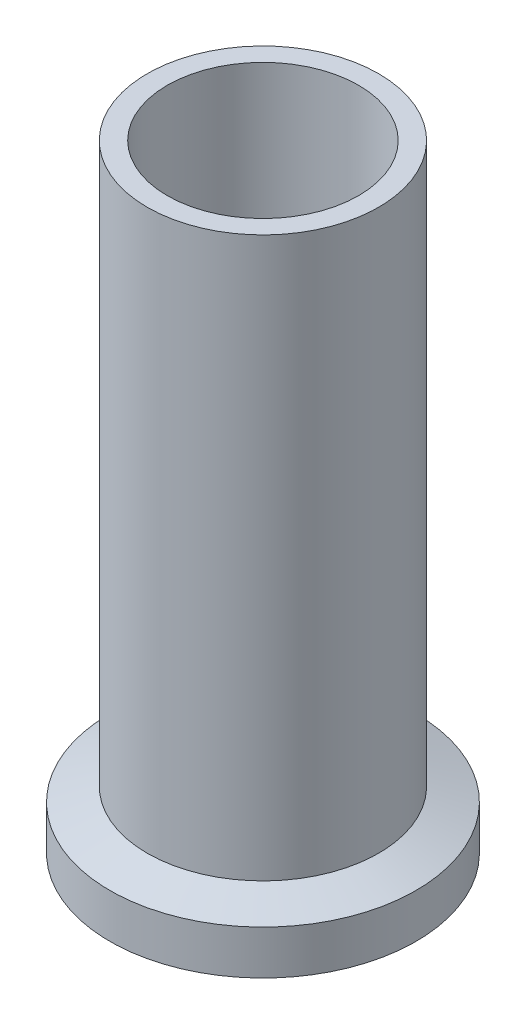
from build123d import *


with BuildPart() as part:
    # Sketch1 → Revolve1 (revolve)
    with BuildSketch(Plane.XY, mode=Mode.PRIVATE) as revolve1_sk:
        with BuildLine():
            Line((-7.874, 0.889), (-7.874, 50.8))
            Line((-7.874, 50.8), (-9.525, 50.8))
            Line((-9.525, 50.8), (-9.525, 4.750826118))
            Line((-9.525, 4.750826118), (-12.5984, 3.6322))
            Line((-12.5984, 3.6322), (-12.5984, 0))
            Line((-12.5984, 0), (-10.922, 0))
            Line((-10.922, 0), (-10.922, 1.3208))
            ThreePointArc((-10.922, 1.3208), (-10.433686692, 2.040621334), (-9.584339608, 1.852998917))
            Line((-9.584339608, 1.852998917), (-8.60238726, 0.889))
            Line((-8.60238726, 0.889), (-7.874, 0.889))
        make_face()
    revolve(revolve1_sk.sketch.rotate(Axis((0, 0, 0), (0, 1, 0)), 270), axis=Axis((0, 0, 0), (0, 1, 0)))


solid = part.part
